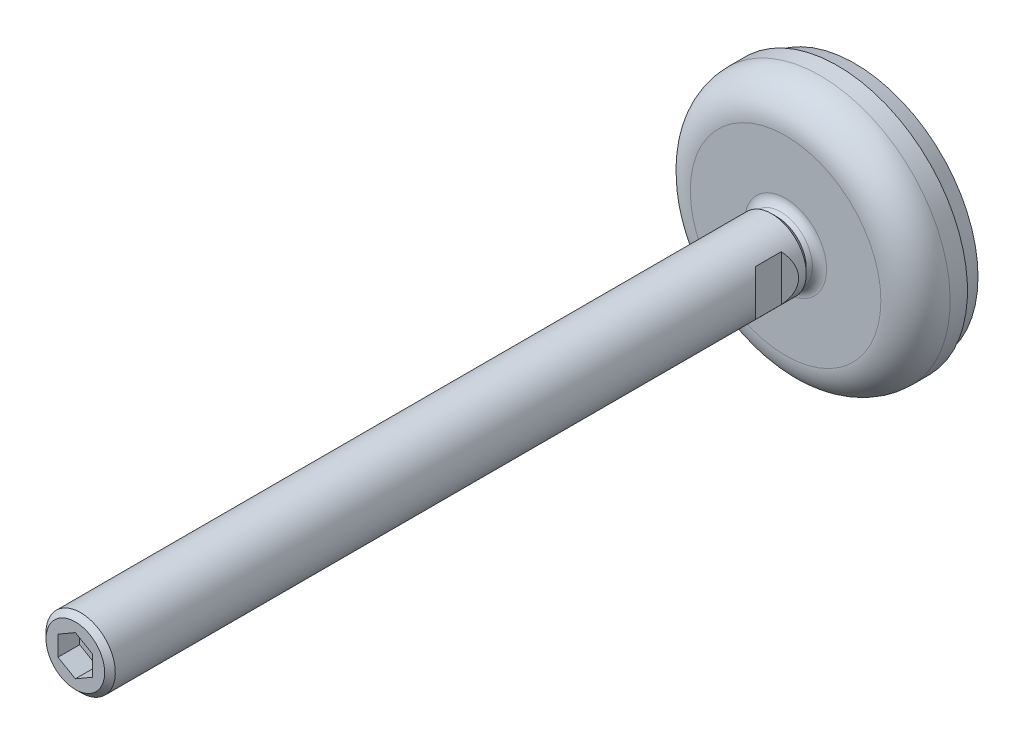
ISO-10303-21;
HEADER;
FILE_DESCRIPTION(('STEP AP214'),'2;1');
FILE_NAME('part.step','',(''),(''),'','','');
FILE_SCHEMA(('AUTOMOTIVE_DESIGN { 1 0 10303 214 1 1 1 1 }'));
ENDSEC;
DATA;
#1=APPLICATION_CONTEXT('core data for automotive mechanical design processes');
#2=APPLICATION_PROTOCOL_DEFINITION('international standard','automotive_design',2000,#1);
#3=PRODUCT_CONTEXT('',#1,'mechanical');
#4=PRODUCT('Part','Part','',(#3));
#5=PRODUCT_RELATED_PRODUCT_CATEGORY('part','',(#4));
#6=PRODUCT_DEFINITION_FORMATION('','',#4);
#7=PRODUCT_DEFINITION_CONTEXT('part definition',#1,'design');
#8=PRODUCT_DEFINITION('design','',#6,#7);
#9=PRODUCT_DEFINITION_SHAPE('','',#8);
#10=(LENGTH_UNIT() NAMED_UNIT(*) SI_UNIT(.MILLI.,.METRE.));
#11=(NAMED_UNIT(*) PLANE_ANGLE_UNIT() SI_UNIT($,.RADIAN.));
#12=(NAMED_UNIT(*) SI_UNIT($,.STERADIAN.) SOLID_ANGLE_UNIT());
#13=UNCERTAINTY_MEASURE_WITH_UNIT(LENGTH_MEASURE(1.E-05),#10,'distance_accuracy_value','');
#14=(GEOMETRIC_REPRESENTATION_CONTEXT(3) GLOBAL_UNCERTAINTY_ASSIGNED_CONTEXT((#13)) GLOBAL_UNIT_ASSIGNED_CONTEXT((#10,
#11,#12)) REPRESENTATION_CONTEXT('',''));
#15=CARTESIAN_POINT('',(0.,0.,0.));
#16=DIRECTION('',(0.,0.,1.));
#17=DIRECTION('',(1.,0.,0.));
#18=AXIS2_PLACEMENT_3D('',#15,#16,#17);
#19=CARTESIAN_POINT('',(0.,0.,19.227));
#20=DIRECTION('',(0.,0.,-1.));
#21=DIRECTION('',(-1.,0.,0.));
#22=AXIS2_PLACEMENT_3D('',#19,#20,#21);
#23=CYLINDRICAL_SURFACE('',#22,8.);
#24=DIRECTION('',(0.,0.,-1.));
#25=VECTOR('',#24,1.);
#26=CARTESIAN_POINT('',(6.,5.29150262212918,19.227));
#27=LINE('',#26,#25);
#28=CARTESIAN_POINT('',(6.,5.29150262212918,23.));
#29=VERTEX_POINT('',#28);
#30=CARTESIAN_POINT('',(6.,5.29150262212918,29.));
#31=VERTEX_POINT('',#30);
#32=EDGE_CURVE('E9',#29,#31,#27,.F.);
#33=ORIENTED_EDGE('',*,*,#32,.F.);
#34=CARTESIAN_POINT('',(0.,0.,29.));
#35=DIRECTION('',(-0.707106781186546,0.,-0.707106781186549));
#36=DIRECTION('',(0.707106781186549,0.,-0.707106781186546));
#37=AXIS2_PLACEMENT_3D('',#34,#35,#36);
#38=ELLIPSE('',#37,11.3137084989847,8.);
#39=CARTESIAN_POINT('',(6.,-5.29150262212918,23.));
#40=VERTEX_POINT('',#39);
#41=EDGE_CURVE('E215',#40,#29,#38,.F.);
#42=ORIENTED_EDGE('',*,*,#41,.F.);
#43=DIRECTION('',(0.,0.,-1.));
#44=VECTOR('',#43,1.);
#45=CARTESIAN_POINT('',(6.,-5.29150262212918,19.227));
#46=LINE('',#45,#44);
#47=CARTESIAN_POINT('',(6.,-5.29150262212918,29.));
#48=VERTEX_POINT('',#47);
#49=EDGE_CURVE('E217',#48,#40,#46,.T.);
#50=ORIENTED_EDGE('',*,*,#49,.F.);
#51=CARTESIAN_POINT('',(0.,0.,23.));
#52=DIRECTION('',(-0.70710678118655,0.,0.707106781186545));
#53=DIRECTION('',(-0.707106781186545,0.,-0.70710678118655));
#54=AXIS2_PLACEMENT_3D('',#51,#52,#53);
#55=ELLIPSE('',#54,11.3137084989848,8.);
#56=EDGE_CURVE('E22',#31,#48,#55,.F.);
#57=ORIENTED_EDGE('',*,*,#56,.F.);
#58=EDGE_LOOP('',(#33,#42,#50,#57));
#59=FACE_BOUND('',#58,.T.);
#60=DIRECTION('',(0.,0.,-1.));
#61=VECTOR('',#60,1.);
#62=CARTESIAN_POINT('',(-6.,-5.29150262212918,19.227));
#63=LINE('',#62,#61);
#64=CARTESIAN_POINT('',(-6.,-5.29150262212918,23.));
#65=VERTEX_POINT('',#64);
#66=CARTESIAN_POINT('',(-6.,-5.29150262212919,29.));
#67=VERTEX_POINT('',#66);
#68=EDGE_CURVE('E209',#65,#67,#63,.F.);
#69=ORIENTED_EDGE('',*,*,#68,.F.);
#70=CARTESIAN_POINT('',(0.,0.,29.));
#71=DIRECTION('',(0.707106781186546,0.,-0.707106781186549));
#72=DIRECTION('',(-0.707106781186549,0.,-0.707106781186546));
#73=AXIS2_PLACEMENT_3D('',#70,#71,#72);
#74=ELLIPSE('',#73,11.3137084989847,8.);
#75=CARTESIAN_POINT('',(-6.,5.29150262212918,23.));
#76=VERTEX_POINT('',#75);
#77=EDGE_CURVE('E212',#76,#65,#74,.F.);
#78=ORIENTED_EDGE('',*,*,#77,.F.);
#79=DIRECTION('',(0.,0.,-1.));
#80=VECTOR('',#79,1.);
#81=CARTESIAN_POINT('',(-6.,5.29150262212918,19.227));
#82=LINE('',#81,#80);
#83=CARTESIAN_POINT('',(-6.,5.29150262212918,29.));
#84=VERTEX_POINT('',#83);
#85=EDGE_CURVE('E186',#84,#76,#82,.T.);
#86=ORIENTED_EDGE('',*,*,#85,.F.);
#87=CARTESIAN_POINT('',(0.,0.,23.));
#88=DIRECTION('',(0.70710678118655,0.,0.707106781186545));
#89=DIRECTION('',(0.707106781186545,0.,-0.70710678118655));
#90=AXIS2_PLACEMENT_3D('',#87,#88,#89);
#91=ELLIPSE('',#90,11.3137084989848,8.);
#92=EDGE_CURVE('E183',#67,#84,#91,.F.);
#93=ORIENTED_EDGE('',*,*,#92,.F.);
#94=EDGE_LOOP('',(#69,#78,#86,#93));
#95=FACE_BOUND('',#94,.T.);
#96=CARTESIAN_POINT('',(0.,0.,178.773));
#97=DIRECTION('',(0.,0.,-1.));
#98=DIRECTION('',(0.,1.,0.));
#99=AXIS2_PLACEMENT_3D('',#96,#97,#98);
#100=CIRCLE('',#99,8.);
#101=CARTESIAN_POINT('',(0.,8.,178.773));
#102=VERTEX_POINT('',#101);
#103=EDGE_CURVE('E191',#102,#102,#100,.T.);
#104=ORIENTED_EDGE('',*,*,#103,.T.);
#105=EDGE_LOOP('',(#104));
#106=FACE_BOUND('',#105,.T.);
#107=CARTESIAN_POINT('',(0.,0.,19.227));
#108=DIRECTION('',(0.,0.,-1.));
#109=DIRECTION('',(0.,1.,0.));
#110=AXIS2_PLACEMENT_3D('',#107,#108,#109);
#111=CIRCLE('',#110,8.);
#112=CARTESIAN_POINT('',(0.,8.,19.227));
#113=VERTEX_POINT('',#112);
#114=EDGE_CURVE('E495',#113,#113,#111,.T.);
#115=ORIENTED_EDGE('',*,*,#114,.F.);
#116=EDGE_LOOP('',(#115));
#117=FACE_BOUND('',#116,.T.);
#118=ADVANCED_FACE('F14',(#59,#95,#106,#117),#23,.T.);
#119=CARTESIAN_POINT('',(0.,0.,18.));
#120=DIRECTION('',(0.,0.,1.));
#121=DIRECTION('',(1.,0.,0.));
#122=AXIS2_PLACEMENT_3D('',#119,#120,#121);
#123=CONICAL_SURFACE('',#122,6.773,0.785398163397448);
#124=ORIENTED_EDGE('',*,*,#114,.T.);
#125=EDGE_LOOP('',(#124));
#126=FACE_BOUND('',#125,.T.);
#127=CARTESIAN_POINT('',(0.,0.,18.));
#128=DIRECTION('',(0.,0.,-1.));
#129=DIRECTION('',(-1.,0.,0.));
#130=AXIS2_PLACEMENT_3D('',#127,#128,#129);
#131=CIRCLE('',#130,6.773);
#132=CARTESIAN_POINT('',(-6.773,0.,18.));
#133=VERTEX_POINT('',#132);
#134=EDGE_CURVE('E493',#133,#133,#131,.T.);
#135=ORIENTED_EDGE('',*,*,#134,.F.);
#136=EDGE_LOOP('',(#135));
#137=FACE_BOUND('',#136,.T.);
#138=ADVANCED_FACE('F388',(#126,#137),#123,.T.);
#139=CARTESIAN_POINT('',(1.93614044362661,0.,11.2805600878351));
#140=DIRECTION('',(0.,1.,0.));
#141=DIRECTION('',(-0.176012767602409,0.,-0.984387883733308));
#142=AXIS2_PLACEMENT_3D('',#139,#140,#141);
#143=CIRCLE('',#142,11.0000000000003);
#144=TRIMMED_CURVE('',#143,(PARAMETER_VALUE(0.)),(PARAMETER_VALUE(2.78772364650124)),.T.,.PARAMETER.);
#145=CARTESIAN_POINT('',(0.,0.,11.2805600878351));
#146=DIRECTION('',(0.,0.,-1.));
#147=AXIS1_PLACEMENT('',#145,#146);
#148=SURFACE_OF_REVOLUTION('',#144,#147);
#149=ORIENTED_EDGE('',*,*,#134,.T.);
#150=EDGE_LOOP('',(#149));
#151=FACE_BOUND('',#150,.T.);
#152=CARTESIAN_POINT('',(0.,0.,17.1630667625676));
#153=DIRECTION('',(0.,0.,-1.));
#154=DIRECTION('',(-1.,0.,0.));
#155=AXIS2_PLACEMENT_3D('',#152,#153,#154);
#156=CIRCLE('',#155,7.35881061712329);
#157=CARTESIAN_POINT('',(-7.35881061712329,0.,17.1630667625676));
#158=VERTEX_POINT('',#157);
#159=EDGE_CURVE('E203',#158,#158,#156,.T.);
#160=ORIENTED_EDGE('',*,*,#159,.F.);
#161=EDGE_LOOP('',(#160));
#162=FACE_BOUND('',#161,.T.);
#163=ADVANCED_FACE('F397',(#151,#162),#148,.F.);
#164=CARTESIAN_POINT('',(0.,0.,18.5));
#165=DIRECTION('',(0.,0.,-1.));
#166=DIRECTION('',(-1.,0.,0.));
#167=AXIS2_PLACEMENT_3D('',#164,#165,#166);
#168=TOROIDAL_SURFACE('',#167,9.4712995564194,2.5);
#169=CARTESIAN_POINT('',(0.,0.,16.));
#170=DIRECTION('',(0.,0.,-1.));
#171=DIRECTION('',(-1.,0.,0.));
#172=AXIS2_PLACEMENT_3D('',#169,#170,#171);
#173=CIRCLE('',#172,9.47129955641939);
#174=CARTESIAN_POINT('',(-9.47129955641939,0.,16.));
#175=VERTEX_POINT('',#174);
#176=EDGE_CURVE('E200',#175,#175,#173,.T.);
#177=ORIENTED_EDGE('',*,*,#176,.F.);
#178=EDGE_LOOP('',(#177));
#179=FACE_BOUND('',#178,.T.);
#180=ORIENTED_EDGE('',*,*,#159,.T.);
#181=EDGE_LOOP('',(#180));
#182=FACE_BOUND('',#181,.T.);
#183=ADVANCED_FACE('F407',(#179,#182),#168,.F.);
#184=CARTESIAN_POINT('',(-22.,22.,16.));
#185=CARTESIAN_POINT('',(-22.,-22.,16.));
#186=CARTESIAN_POINT('',(-22.,-22.44,16.));
#187=B_SPLINE_CURVE_WITH_KNOTS('',1,(#184,#185,#186),.UNSPECIFIED.,.F.,.F.,(2,1,2),(0.,1.,1.01),.UNSPECIFIED.);
#188=DIRECTION('',(1.,0.,0.));
#189=VECTOR('',#188,1.);
#190=SURFACE_OF_LINEAR_EXTRUSION('',#187,#189);
#191=ORIENTED_EDGE('',*,*,#176,.T.);
#192=EDGE_LOOP('',(#191));
#193=FACE_BOUND('',#192,.T.);
#194=CARTESIAN_POINT('',(0.,0.,16.));
#195=DIRECTION('',(0.,0.,-1.));
#196=DIRECTION('',(-1.,0.,0.));
#197=AXIS2_PLACEMENT_3D('',#194,#195,#196);
#198=CIRCLE('',#197,22.);
#199=CARTESIAN_POINT('',(-22.,0.,16.));
#200=VERTEX_POINT('',#199);
#201=EDGE_CURVE('E197',#200,#200,#198,.T.);
#202=ORIENTED_EDGE('',*,*,#201,.F.);
#203=EDGE_LOOP('',(#202));
#204=FACE_BOUND('',#203,.T.);
#205=ADVANCED_FACE('F415',(#193,#204),#190,.T.);
#206=CARTESIAN_POINT('',(0.,0.,8.));
#207=DIRECTION('',(0.,0.,-1.));
#208=DIRECTION('',(-1.,0.,0.));
#209=AXIS2_PLACEMENT_3D('',#206,#207,#208);
#210=TOROIDAL_SURFACE('',#209,22.,8.);
#211=ORIENTED_EDGE('',*,*,#201,.T.);
#212=EDGE_LOOP('',(#211));
#213=FACE_BOUND('',#212,.T.);
#214=CARTESIAN_POINT('',(0.,0.,8.));
#215=DIRECTION('',(0.,0.,-1.));
#216=DIRECTION('',(0.,1.,0.));
#217=AXIS2_PLACEMENT_3D('',#214,#215,#216);
#218=CIRCLE('',#217,30.);
#219=CARTESIAN_POINT('',(0.,30.,8.));
#220=VERTEX_POINT('',#219);
#221=EDGE_CURVE('E196',#220,#220,#218,.T.);
#222=ORIENTED_EDGE('',*,*,#221,.F.);
#223=EDGE_LOOP('',(#222));
#224=FACE_BOUND('',#223,.T.);
#225=ADVANCED_FACE('F420',(#213,#224),#210,.T.);
#226=CARTESIAN_POINT('',(0.,0.,4.));
#227=DIRECTION('',(0.,0.,-1.));
#228=DIRECTION('',(-1.,0.,0.));
#229=AXIS2_PLACEMENT_3D('',#226,#227,#228);
#230=CYLINDRICAL_SURFACE('',#229,30.);
#231=CARTESIAN_POINT('',(0.,0.,4.));
#232=DIRECTION('',(0.,0.,-1.));
#233=DIRECTION('',(-1.,0.,0.));
#234=AXIS2_PLACEMENT_3D('',#231,#232,#233);
#235=CIRCLE('',#234,30.);
#236=CARTESIAN_POINT('',(-30.,0.,4.));
#237=VERTEX_POINT('',#236);
#238=EDGE_CURVE('E188',#237,#237,#235,.T.);
#239=ORIENTED_EDGE('',*,*,#238,.F.);
#240=EDGE_LOOP('',(#239));
#241=FACE_BOUND('',#240,.T.);
#242=ORIENTED_EDGE('',*,*,#221,.T.);
#243=EDGE_LOOP('',(#242));
#244=FACE_BOUND('',#243,.T.);
#245=ADVANCED_FACE('F430',(#241,#244),#230,.T.);
#246=CARTESIAN_POINT('',(-30.3600010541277,-30.,4.));
#247=DIRECTION('',(0.,0.,-1.));
#248=DIRECTION('',(0.,1.,0.));
#249=AXIS2_PLACEMENT_3D('',#246,#247,#248);
#250=PLANE('',#249);
#251=CARTESIAN_POINT('',(0.,0.,4.));
#252=DIRECTION('',(0.,0.,1.));
#253=DIRECTION('',(1.,0.,0.));
#254=AXIS2_PLACEMENT_3D('',#251,#252,#253);
#255=CIRCLE('',#254,29.5);
#256=CARTESIAN_POINT('',(29.5,0.,4.));
#257=VERTEX_POINT('',#256);
#258=EDGE_CURVE('E179',#257,#257,#255,.F.);
#259=ORIENTED_EDGE('',*,*,#258,.F.);
#260=EDGE_LOOP('',(#259));
#261=FACE_BOUND('',#260,.T.);
#262=ORIENTED_EDGE('',*,*,#238,.T.);
#263=EDGE_LOOP('',(#262));
#264=FACE_BOUND('',#263,.T.);
#265=ADVANCED_FACE('F174',(#261,#264),#250,.T.);
#266=CARTESIAN_POINT('',(-28.7693427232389,-28.4282032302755,0.));
#267=DIRECTION('',(0.,0.,-1.));
#268=DIRECTION('',(0.,1.,0.));
#269=AXIS2_PLACEMENT_3D('',#266,#267,#268);
#270=PLANE('',#269);
#271=CARTESIAN_POINT('',(0.,0.,0.));
#272=DIRECTION('',(0.,0.,1.));
#273=DIRECTION('',(1.,0.,0.));
#274=AXIS2_PLACEMENT_3D('',#271,#272,#273);
#275=CIRCLE('',#274,28.4282032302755);
#276=CARTESIAN_POINT('',(28.4282032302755,0.,0.));
#277=VERTEX_POINT('',#276);
#278=EDGE_CURVE('E182',#277,#277,#275,.T.);
#279=ORIENTED_EDGE('',*,*,#278,.F.);
#280=EDGE_LOOP('',(#279));
#281=FACE_BOUND('',#280,.T.);
#282=ADVANCED_FACE('F165',(#281),#270,.T.);
#283=CARTESIAN_POINT('',(0.,0.,0.));
#284=DIRECTION('',(0.,0.,1.));
#285=DIRECTION('',(1.,0.,0.));
#286=AXIS2_PLACEMENT_3D('',#283,#284,#285);
#287=CONICAL_SURFACE('',#286,28.4282032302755,0.261799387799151);
#288=ORIENTED_EDGE('',*,*,#258,.T.);
#289=EDGE_LOOP('',(#288));
#290=FACE_BOUND('',#289,.T.);
#291=ORIENTED_EDGE('',*,*,#278,.T.);
#292=EDGE_LOOP('',(#291));
#293=FACE_BOUND('',#292,.T.);
#294=ADVANCED_FACE('F16',(#290,#293),#287,.T.);
#295=CARTESIAN_POINT('',(-4.,-4.67422777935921,175.));
#296=DIRECTION('',(0.,0.,1.));
#297=DIRECTION('',(1.,0.,0.));
#298=AXIS2_PLACEMENT_3D('',#295,#296,#297);
#299=PLANE('',#298);
#300=DIRECTION('',(0.866025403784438,0.5,0.));
#301=VECTOR('',#300,1.);
#302=CARTESIAN_POINT('',(-2.,3.46410161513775,175.));
#303=LINE('',#302,#301);
#304=CARTESIAN_POINT('',(-4.,2.3094010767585,175.));
#305=VERTEX_POINT('',#304);
#306=CARTESIAN_POINT('',(1.08254311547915E-07,4.61880209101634,175.));
#307=VERTEX_POINT('',#306);
#308=EDGE_CURVE('E138',#305,#307,#303,.T.);
#309=ORIENTED_EDGE('',*,*,#308,.F.);
#310=DIRECTION('',(0.,1.,0.));
#311=VECTOR('',#310,1.);
#312=CARTESIAN_POINT('',(-4.,0.,175.));
#313=LINE('',#312,#311);
#314=CARTESIAN_POINT('',(-4.,-2.3094010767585,175.));
#315=VERTEX_POINT('',#314);
#316=EDGE_CURVE('E72',#315,#305,#313,.T.);
#317=ORIENTED_EDGE('',*,*,#316,.F.);
#318=DIRECTION('',(-0.866025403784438,0.5,0.));
#319=VECTOR('',#318,1.);
#320=CARTESIAN_POINT('',(-2.,-3.46410161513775,175.));
#321=LINE('',#320,#319);
#322=CARTESIAN_POINT('',(-2.16508679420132E-07,-4.61880202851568,175.));
#323=VERTEX_POINT('',#322);
#324=EDGE_CURVE('E68',#323,#315,#321,.T.);
#325=ORIENTED_EDGE('',*,*,#324,.F.);
#326=DIRECTION('',(-0.866025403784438,-0.5,0.));
#327=VECTOR('',#326,1.);
#328=CARTESIAN_POINT('',(2.,-3.46410161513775,175.));
#329=LINE('',#328,#327);
#330=CARTESIAN_POINT('',(4.,-2.3094010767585,175.));
#331=VERTEX_POINT('',#330);
#332=EDGE_CURVE('E91',#331,#323,#329,.T.);
#333=ORIENTED_EDGE('',*,*,#332,.F.);
#334=DIRECTION('',(0.,-1.,0.));
#335=VECTOR('',#334,1.);
#336=CARTESIAN_POINT('',(4.,0.,175.));
#337=LINE('',#336,#335);
#338=CARTESIAN_POINT('',(4.,2.3094010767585,175.));
#339=VERTEX_POINT('',#338);
#340=EDGE_CURVE('E149',#339,#331,#337,.T.);
#341=ORIENTED_EDGE('',*,*,#340,.F.);
#342=DIRECTION('',(0.866025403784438,-0.5,0.));
#343=VECTOR('',#342,1.);
#344=CARTESIAN_POINT('',(2.,3.46410161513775,175.));
#345=LINE('',#344,#343);
#346=EDGE_CURVE('E142',#307,#339,#345,.T.);
#347=ORIENTED_EDGE('',*,*,#346,.F.);
#348=EDGE_LOOP('',(#309,#317,#325,#333,#341,#347));
#349=FACE_BOUND('',#348,.T.);
#350=ADVANCED_FACE('F164',(#349),#299,.T.);
#351=CARTESIAN_POINT('',(4.,2.3094010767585,180.));
#352=DIRECTION('',(-0.5,-0.866025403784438,0.));
#353=DIRECTION('',(-0.866025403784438,0.5,0.));
#354=AXIS2_PLACEMENT_3D('',#351,#352,#353);
#355=PLANE('',#354);
#356=ORIENTED_EDGE('',*,*,#346,.T.);
#357=DIRECTION('',(0.,0.,-1.));
#358=VECTOR('',#357,1.);
#359=CARTESIAN_POINT('',(4.,2.3094010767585,180.));
#360=LINE('',#359,#358);
#361=CARTESIAN_POINT('',(4.,2.3094010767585,180.));
#362=VERTEX_POINT('',#361);
#363=EDGE_CURVE('E146',#362,#339,#360,.T.);
#364=ORIENTED_EDGE('',*,*,#363,.F.);
#365=CARTESIAN_POINT('',(0.,4.61880215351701,180.));
#366=CARTESIAN_POINT('',(0.166666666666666,4.52257710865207,180.));
#367=CARTESIAN_POINT('',(0.333333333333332,4.42635206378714,180.));
#368=CARTESIAN_POINT('',(0.666666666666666,4.23390197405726,180.));
#369=CARTESIAN_POINT('',(0.833333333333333,4.13767692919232,180.));
#370=CARTESIAN_POINT('',(1.16666666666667,3.94522683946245,180.));
#371=CARTESIAN_POINT('',(1.33333333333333,3.84900179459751,180.));
#372=CARTESIAN_POINT('',(1.66666666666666,3.65655170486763,180.));
#373=CARTESIAN_POINT('',(1.83333333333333,3.56032666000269,180.));
#374=CARTESIAN_POINT('',(2.16666666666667,3.36787657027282,180.));
#375=CARTESIAN_POINT('',(2.33333333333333,3.27165152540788,180.));
#376=CARTESIAN_POINT('',(2.66666666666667,3.079201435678,180.));
#377=CARTESIAN_POINT('',(2.83333333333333,2.98297639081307,180.));
#378=CARTESIAN_POINT('',(3.16666666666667,2.79052630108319,180.));
#379=CARTESIAN_POINT('',(3.33333333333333,2.69430125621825,180.));
#380=CARTESIAN_POINT('',(3.66666666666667,2.50185116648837,180.));
#381=CARTESIAN_POINT('',(3.83333333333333,2.40562612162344,180.));
#382=CARTESIAN_POINT('',(4.,2.3094010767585,180.));
#383=B_SPLINE_CURVE_WITH_KNOTS('',3,(#365,#366,#367,#368,#369,#370,#371,#372,#373,#374,#375,
#376,#377,#378,#379,#380,#381,#382),.UNSPECIFIED.,.F.,.F.,(4,2,2,2,2,2,2,2,4),(0.,
0.577350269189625,1.15470053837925,1.73205080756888,2.3094010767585,2.88675134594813,
3.46410161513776,4.04145188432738,4.61880215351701),.UNSPECIFIED.);
#384=CARTESIAN_POINT('',(-6.25172192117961E-08,4.61880211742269,180.));
#385=VERTEX_POINT('',#384);
#386=EDGE_CURVE('E120',#385,#362,#383,.T.);
#387=ORIENTED_EDGE('',*,*,#386,.F.);
#388=DIRECTION('',(0.,0.,-1.));
#389=VECTOR('',#388,1.);
#390=CARTESIAN_POINT('',(0.,4.61880215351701,180.));
#391=LINE('',#390,#389);
#392=EDGE_CURVE('E135',#385,#307,#391,.T.);
#393=ORIENTED_EDGE('',*,*,#392,.T.);
#394=EDGE_LOOP('',(#356,#364,#387,#393));
#395=FACE_BOUND('',#394,.T.);
#396=ADVANCED_FACE('F144',(#395),#355,.T.);
#397=CARTESIAN_POINT('',(0.,4.61880215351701,180.));
#398=DIRECTION('',(0.5,-0.866025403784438,0.));
#399=DIRECTION('',(-0.866025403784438,-0.5,0.));
#400=AXIS2_PLACEMENT_3D('',#397,#398,#399);
#401=PLANE('',#400);
#402=ORIENTED_EDGE('',*,*,#308,.T.);
#403=ORIENTED_EDGE('',*,*,#392,.F.);
#404=CARTESIAN_POINT('',(-4.,2.3094010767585,180.));
#405=CARTESIAN_POINT('',(-3.83333333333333,2.40562612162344,180.));
#406=CARTESIAN_POINT('',(-3.66666666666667,2.50185116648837,180.));
#407=CARTESIAN_POINT('',(-3.33333333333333,2.69430125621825,180.));
#408=CARTESIAN_POINT('',(-3.16666666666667,2.79052630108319,180.));
#409=CARTESIAN_POINT('',(-2.83333333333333,2.98297639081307,180.));
#410=CARTESIAN_POINT('',(-2.66666666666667,3.079201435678,180.));
#411=CARTESIAN_POINT('',(-2.33333333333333,3.27165152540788,180.));
#412=CARTESIAN_POINT('',(-2.16666666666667,3.36787657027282,180.));
#413=CARTESIAN_POINT('',(-1.83333333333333,3.56032666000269,180.));
#414=CARTESIAN_POINT('',(-1.66666666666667,3.65655170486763,180.));
#415=CARTESIAN_POINT('',(-1.33333333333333,3.84900179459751,180.));
#416=CARTESIAN_POINT('',(-1.16666666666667,3.94522683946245,180.));
#417=CARTESIAN_POINT('',(-0.833333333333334,4.13767692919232,180.));
#418=CARTESIAN_POINT('',(-0.666666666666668,4.23390197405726,180.));
#419=CARTESIAN_POINT('',(-0.333333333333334,4.42635206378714,180.));
#420=CARTESIAN_POINT('',(-0.166666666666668,4.52257710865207,180.));
#421=CARTESIAN_POINT('',(0.,4.61880215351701,180.));
#422=B_SPLINE_CURVE_WITH_KNOTS('',3,(#404,#405,#406,#407,#408,#409,#410,#411,#412,#413,#414,
#415,#416,#417,#418,#419,#420,#421),.UNSPECIFIED.,.F.,.F.,(4,2,2,2,2,2,2,2,4),(0.,
0.577350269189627,1.15470053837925,1.73205080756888,2.3094010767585,2.88675134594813,
3.46410161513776,4.04145188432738,4.61880215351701),.UNSPECIFIED.);
#423=CARTESIAN_POINT('',(-4.,2.3094010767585,180.));
#424=VERTEX_POINT('',#423);
#425=EDGE_CURVE('E82',#424,#385,#422,.T.);
#426=ORIENTED_EDGE('',*,*,#425,.F.);
#427=DIRECTION('',(0.,0.,-1.));
#428=VECTOR('',#427,1.);
#429=CARTESIAN_POINT('',(-4.,2.3094010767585,180.));
#430=LINE('',#429,#428);
#431=EDGE_CURVE('E78',#424,#305,#430,.T.);
#432=ORIENTED_EDGE('',*,*,#431,.T.);
#433=EDGE_LOOP('',(#402,#403,#426,#432));
#434=FACE_BOUND('',#433,.T.);
#435=ADVANCED_FACE('F132',(#434),#401,.T.);
#436=CARTESIAN_POINT('',(-4.,2.3094010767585,180.));
#437=DIRECTION('',(1.,0.,0.));
#438=DIRECTION('',(0.,-1.,0.));
#439=AXIS2_PLACEMENT_3D('',#436,#437,#438);
#440=PLANE('',#439);
#441=ORIENTED_EDGE('',*,*,#316,.T.);
#442=ORIENTED_EDGE('',*,*,#431,.F.);
#443=DIRECTION('',(0.,1.,0.));
#444=VECTOR('',#443,1.);
#445=CARTESIAN_POINT('',(-4.,0.,180.));
#446=LINE('',#445,#444);
#447=CARTESIAN_POINT('',(-4.,-2.3094010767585,180.));
#448=VERTEX_POINT('',#447);
#449=EDGE_CURVE('E75',#448,#424,#446,.T.);
#450=ORIENTED_EDGE('',*,*,#449,.F.);
#451=DIRECTION('',(0.,0.,-1.));
#452=VECTOR('',#451,1.);
#453=CARTESIAN_POINT('',(-4.,-2.3094010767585,180.));
#454=LINE('',#453,#452);
#455=EDGE_CURVE('E59',#448,#315,#454,.T.);
#456=ORIENTED_EDGE('',*,*,#455,.T.);
#457=EDGE_LOOP('',(#441,#442,#450,#456));
#458=FACE_BOUND('',#457,.T.);
#459=ADVANCED_FACE('F76',(#458),#440,.T.);
#460=CARTESIAN_POINT('',(-4.,-2.3094010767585,180.));
#461=DIRECTION('',(0.5,0.866025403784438,0.));
#462=DIRECTION('',(0.866025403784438,-0.5,0.));
#463=AXIS2_PLACEMENT_3D('',#460,#461,#462);
#464=PLANE('',#463);
#465=ORIENTED_EDGE('',*,*,#324,.T.);
#466=ORIENTED_EDGE('',*,*,#455,.F.);
#467=CARTESIAN_POINT('',(0.,-4.61880215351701,180.));
#468=CARTESIAN_POINT('',(-0.166666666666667,-4.52257710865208,180.));
#469=CARTESIAN_POINT('',(-0.333333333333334,-4.42635206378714,180.));
#470=CARTESIAN_POINT('',(-0.666666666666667,-4.23390197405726,180.));
#471=CARTESIAN_POINT('',(-0.833333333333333,-4.13767692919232,180.));
#472=CARTESIAN_POINT('',(-1.16666666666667,-3.94522683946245,180.));
#473=CARTESIAN_POINT('',(-1.33333333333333,-3.84900179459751,180.));
#474=CARTESIAN_POINT('',(-1.66666666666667,-3.65655170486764,180.));
#475=CARTESIAN_POINT('',(-1.83333333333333,-3.5603266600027,180.));
#476=CARTESIAN_POINT('',(-2.16666666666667,-3.36787657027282,180.));
#477=CARTESIAN_POINT('',(-2.33333333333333,-3.27165152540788,180.));
#478=CARTESIAN_POINT('',(-2.66666666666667,-3.07920143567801,180.));
#479=CARTESIAN_POINT('',(-2.83333333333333,-2.98297639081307,180.));
#480=CARTESIAN_POINT('',(-3.16666666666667,-2.7905263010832,180.));
#481=CARTESIAN_POINT('',(-3.33333333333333,-2.69430125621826,180.));
#482=CARTESIAN_POINT('',(-3.66666666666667,-2.50185116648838,180.));
#483=CARTESIAN_POINT('',(-3.83333333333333,-2.40562612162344,180.));
#484=CARTESIAN_POINT('',(-4.,-2.30940107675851,180.));
#485=B_SPLINE_CURVE_WITH_KNOTS('',3,(#467,#468,#469,#470,#471,#472,#473,#474,#475,#476,#477,
#478,#479,#480,#481,#482,#483,#484),.UNSPECIFIED.,.F.,.F.,(4,2,2,2,2,2,2,2,4),(0.,
0.577350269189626,1.15470053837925,1.73205080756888,2.3094010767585,2.88675134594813,
3.46410161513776,4.04145188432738,4.61880215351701),.UNSPECIFIED.);
#486=CARTESIAN_POINT('',(-6.25172198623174E-08,-4.61880211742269,180.));
#487=VERTEX_POINT('',#486);
#488=EDGE_CURVE('E64',#487,#448,#485,.T.);
#489=ORIENTED_EDGE('',*,*,#488,.F.);
#490=DIRECTION('',(0.,0.,-1.));
#491=VECTOR('',#490,1.);
#492=CARTESIAN_POINT('',(0.,-4.61880215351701,180.));
#493=LINE('',#492,#491);
#494=EDGE_CURVE('E89',#323,#487,#493,.F.);
#495=ORIENTED_EDGE('',*,*,#494,.F.);
#496=EDGE_LOOP('',(#465,#466,#489,#495));
#497=FACE_BOUND('',#496,.T.);
#498=ADVANCED_FACE('F61',(#497),#464,.T.);
#499=CARTESIAN_POINT('',(0.,-4.61880215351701,180.));
#500=DIRECTION('',(-0.5,0.866025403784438,0.));
#501=DIRECTION('',(0.866025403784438,0.5,0.));
#502=AXIS2_PLACEMENT_3D('',#499,#500,#501);
#503=PLANE('',#502);
#504=ORIENTED_EDGE('',*,*,#332,.T.);
#505=ORIENTED_EDGE('',*,*,#494,.T.);
#506=CARTESIAN_POINT('',(4.,-2.30940107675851,180.));
#507=CARTESIAN_POINT('',(3.83333333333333,-2.40562612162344,180.));
#508=CARTESIAN_POINT('',(3.66666666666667,-2.50185116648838,180.));
#509=CARTESIAN_POINT('',(3.33333333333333,-2.69430125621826,180.));
#510=CARTESIAN_POINT('',(3.16666666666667,-2.7905263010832,180.));
#511=CARTESIAN_POINT('',(2.83333333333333,-2.98297639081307,180.));
#512=CARTESIAN_POINT('',(2.66666666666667,-3.07920143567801,180.));
#513=CARTESIAN_POINT('',(2.33333333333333,-3.27165152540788,180.));
#514=CARTESIAN_POINT('',(2.16666666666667,-3.36787657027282,180.));
#515=CARTESIAN_POINT('',(1.83333333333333,-3.5603266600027,180.));
#516=CARTESIAN_POINT('',(1.66666666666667,-3.65655170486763,180.));
#517=CARTESIAN_POINT('',(1.33333333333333,-3.84900179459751,180.));
#518=CARTESIAN_POINT('',(1.16666666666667,-3.94522683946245,180.));
#519=CARTESIAN_POINT('',(0.833333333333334,-4.13767692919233,180.));
#520=CARTESIAN_POINT('',(0.666666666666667,-4.23390197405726,180.));
#521=CARTESIAN_POINT('',(0.333333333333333,-4.42635206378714,180.));
#522=CARTESIAN_POINT('',(0.166666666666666,-4.52257710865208,180.));
#523=CARTESIAN_POINT('',(0.,-4.61880215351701,180.));
#524=B_SPLINE_CURVE_WITH_KNOTS('',3,(#506,#507,#508,#509,#510,#511,#512,#513,#514,#515,#516,
#517,#518,#519,#520,#521,#522,#523),.UNSPECIFIED.,.F.,.F.,(4,2,2,2,2,2,2,2,4),(0.,
0.577350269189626,1.15470053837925,1.73205080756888,2.3094010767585,2.88675134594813,
3.46410161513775,4.04145188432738,4.61880215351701),.UNSPECIFIED.);
#525=CARTESIAN_POINT('',(4.,-2.3094010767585,180.));
#526=VERTEX_POINT('',#525);
#527=EDGE_CURVE('E88',#526,#487,#524,.T.);
#528=ORIENTED_EDGE('',*,*,#527,.F.);
#529=DIRECTION('',(0.,0.,-1.));
#530=VECTOR('',#529,1.);
#531=CARTESIAN_POINT('',(4.,-2.3094010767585,180.));
#532=LINE('',#531,#530);
#533=EDGE_CURVE('E37',#526,#331,#532,.T.);
#534=ORIENTED_EDGE('',*,*,#533,.T.);
#535=EDGE_LOOP('',(#504,#505,#528,#534));
#536=FACE_BOUND('',#535,.T.);
#537=ADVANCED_FACE('F111',(#536),#503,.T.);
#538=CARTESIAN_POINT('',(4.,-2.3094010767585,180.));
#539=DIRECTION('',(-1.,0.,0.));
#540=DIRECTION('',(0.,1.,0.));
#541=AXIS2_PLACEMENT_3D('',#538,#539,#540);
#542=PLANE('',#541);
#543=ORIENTED_EDGE('',*,*,#340,.T.);
#544=ORIENTED_EDGE('',*,*,#533,.F.);
#545=DIRECTION('',(0.,-1.,0.));
#546=VECTOR('',#545,1.);
#547=CARTESIAN_POINT('',(4.,0.,180.));
#548=LINE('',#547,#546);
#549=EDGE_CURVE('E123',#362,#526,#548,.T.);
#550=ORIENTED_EDGE('',*,*,#549,.F.);
#551=ORIENTED_EDGE('',*,*,#363,.T.);
#552=EDGE_LOOP('',(#543,#544,#550,#551));
#553=FACE_BOUND('',#552,.T.);
#554=ADVANCED_FACE('F151',(#553),#542,.T.);
#555=CARTESIAN_POINT('',(-6.85427810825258,6.773,180.));
#556=DIRECTION('',(0.,0.,1.));
#557=DIRECTION('',(0.,-1.,0.));
#558=AXIS2_PLACEMENT_3D('',#555,#556,#557);
#559=PLANE('',#558);
#560=ORIENTED_EDGE('',*,*,#549,.T.);
#561=ORIENTED_EDGE('',*,*,#527,.T.);
#562=ORIENTED_EDGE('',*,*,#488,.T.);
#563=ORIENTED_EDGE('',*,*,#449,.T.);
#564=ORIENTED_EDGE('',*,*,#425,.T.);
#565=ORIENTED_EDGE('',*,*,#386,.T.);
#566=EDGE_LOOP('',(#560,#561,#562,#563,#564,#565));
#567=FACE_BOUND('',#566,.T.);
#568=CARTESIAN_POINT('',(0.,0.,180.));
#569=DIRECTION('',(0.,0.,-1.));
#570=DIRECTION('',(-1.,0.,0.));
#571=AXIS2_PLACEMENT_3D('',#568,#569,#570);
#572=CIRCLE('',#571,6.773);
#573=CARTESIAN_POINT('',(-6.77300000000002,0.,180.));
#574=VERTEX_POINT('',#573);
#575=EDGE_CURVE('E204',#574,#574,#572,.T.);
#576=ORIENTED_EDGE('',*,*,#575,.F.);
#577=EDGE_LOOP('',(#576));
#578=FACE_BOUND('',#577,.T.);
#579=ADVANCED_FACE('F86',(#567,#578),#559,.T.);
#580=CARTESIAN_POINT('',(0.,0.,180.));
#581=DIRECTION('',(0.,0.,-1.));
#582=DIRECTION('',(-1.,0.,0.));
#583=AXIS2_PLACEMENT_3D('',#580,#581,#582);
#584=CONICAL_SURFACE('',#583,6.773,0.785398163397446);
#585=ORIENTED_EDGE('',*,*,#103,.F.);
#586=EDGE_LOOP('',(#585));
#587=FACE_BOUND('',#586,.T.);
#588=ORIENTED_EDGE('',*,*,#575,.T.);
#589=EDGE_LOOP('',(#588));
#590=FACE_BOUND('',#589,.T.);
#591=ADVANCED_FACE('F160',(#587,#590),#584,.T.);
#592=CARTESIAN_POINT('',(-8.,-10.,21.));
#593=DIRECTION('',(0.707106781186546,0.,-0.707106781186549));
#594=DIRECTION('',(-0.707106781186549,0.,-0.707106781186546));
#595=AXIS2_PLACEMENT_3D('',#592,#593,#594);
#596=PLANE('',#595);
#597=ORIENTED_EDGE('',*,*,#77,.T.);
#598=DIRECTION('',(0.,1.,0.));
#599=VECTOR('',#598,1.);
#600=CARTESIAN_POINT('',(-6.,-10.,23.));
#601=LINE('',#600,#599);
#602=EDGE_CURVE('E242',#65,#76,#601,.T.);
#603=ORIENTED_EDGE('',*,*,#602,.T.);
#604=EDGE_LOOP('',(#597,#603));
#605=FACE_BOUND('',#604,.T.);
#606=ADVANCED_FACE('F286',(#605),#596,.F.);
#607=CARTESIAN_POINT('',(-6.,-10.,23.));
#608=DIRECTION('',(1.,0.,0.));
#609=DIRECTION('',(0.,0.,-1.));
#610=AXIS2_PLACEMENT_3D('',#607,#608,#609);
#611=PLANE('',#610);
#612=ORIENTED_EDGE('',*,*,#68,.T.);
#613=DIRECTION('',(0.,1.,0.));
#614=VECTOR('',#613,1.);
#615=CARTESIAN_POINT('',(-6.,-10.,29.));
#616=LINE('',#615,#614);
#617=EDGE_CURVE('E235',#67,#84,#616,.T.);
#618=ORIENTED_EDGE('',*,*,#617,.T.);
#619=ORIENTED_EDGE('',*,*,#85,.T.);
#620=ORIENTED_EDGE('',*,*,#602,.F.);
#621=EDGE_LOOP('',(#612,#618,#619,#620));
#622=FACE_BOUND('',#621,.T.);
#623=ADVANCED_FACE('F276',(#622),#611,.F.);
#624=CARTESIAN_POINT('',(-6.,-10.,29.));
#625=DIRECTION('',(0.70710678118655,0.,0.707106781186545));
#626=DIRECTION('',(0.707106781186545,0.,-0.70710678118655));
#627=AXIS2_PLACEMENT_3D('',#624,#625,#626);
#628=PLANE('',#627);
#629=ORIENTED_EDGE('',*,*,#617,.F.);
#630=ORIENTED_EDGE('',*,*,#92,.T.);
#631=EDGE_LOOP('',(#629,#630));
#632=FACE_BOUND('',#631,.T.);
#633=ADVANCED_FACE('F277',(#632),#628,.F.);
#634=CARTESIAN_POINT('',(6.,-10.,29.));
#635=DIRECTION('',(-0.70710678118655,0.,0.707106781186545));
#636=DIRECTION('',(0.707106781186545,0.,0.70710678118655));
#637=AXIS2_PLACEMENT_3D('',#634,#635,#636);
#638=PLANE('',#637);
#639=DIRECTION('',(0.,1.,0.));
#640=VECTOR('',#639,1.);
#641=CARTESIAN_POINT('',(6.,-10.,29.));
#642=LINE('',#641,#640);
#643=EDGE_CURVE('E226',#48,#31,#642,.T.);
#644=ORIENTED_EDGE('',*,*,#643,.T.);
#645=ORIENTED_EDGE('',*,*,#56,.T.);
#646=EDGE_LOOP('',(#644,#645));
#647=FACE_BOUND('',#646,.T.);
#648=ADVANCED_FACE('F224',(#647),#638,.F.);
#649=CARTESIAN_POINT('',(6.,-10.,23.));
#650=DIRECTION('',(-1.,0.,0.));
#651=DIRECTION('',(0.,0.,1.));
#652=AXIS2_PLACEMENT_3D('',#649,#650,#651);
#653=PLANE('',#652);
#654=ORIENTED_EDGE('',*,*,#32,.T.);
#655=ORIENTED_EDGE('',*,*,#643,.F.);
#656=ORIENTED_EDGE('',*,*,#49,.T.);
#657=DIRECTION('',(0.,1.,0.));
#658=VECTOR('',#657,1.);
#659=CARTESIAN_POINT('',(6.,-10.,23.));
#660=LINE('',#659,#658);
#661=EDGE_CURVE('E28',#40,#29,#660,.T.);
#662=ORIENTED_EDGE('',*,*,#661,.T.);
#663=EDGE_LOOP('',(#654,#655,#656,#662));
#664=FACE_BOUND('',#663,.T.);
#665=ADVANCED_FACE('F233',(#664),#653,.F.);
#666=CARTESIAN_POINT('',(8.,-10.,21.));
#667=DIRECTION('',(-0.707106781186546,0.,-0.707106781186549));
#668=DIRECTION('',(-0.707106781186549,0.,0.707106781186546));
#669=AXIS2_PLACEMENT_3D('',#666,#667,#668);
#670=PLANE('',#669);
#671=ORIENTED_EDGE('',*,*,#41,.T.);
#672=ORIENTED_EDGE('',*,*,#661,.F.);
#673=EDGE_LOOP('',(#671,#672));
#674=FACE_BOUND('',#673,.T.);
#675=ADVANCED_FACE('F238',(#674),#670,.F.);
#676=CLOSED_SHELL('',(#118,#138,#163,#183,#205,#225,#245,#265,#282,#294,#350,#396,#435,#459,
#498,#537,#554,#579,#591,#606,#623,#633,#648,#665,#675));
#677=MANIFOLD_SOLID_BREP('B1',#676);
#678=ADVANCED_BREP_SHAPE_REPRESENTATION('',(#18,#677),#14);
#679=SHAPE_DEFINITION_REPRESENTATION(#9,#678);
ENDSEC;
END-ISO-10303-21;
